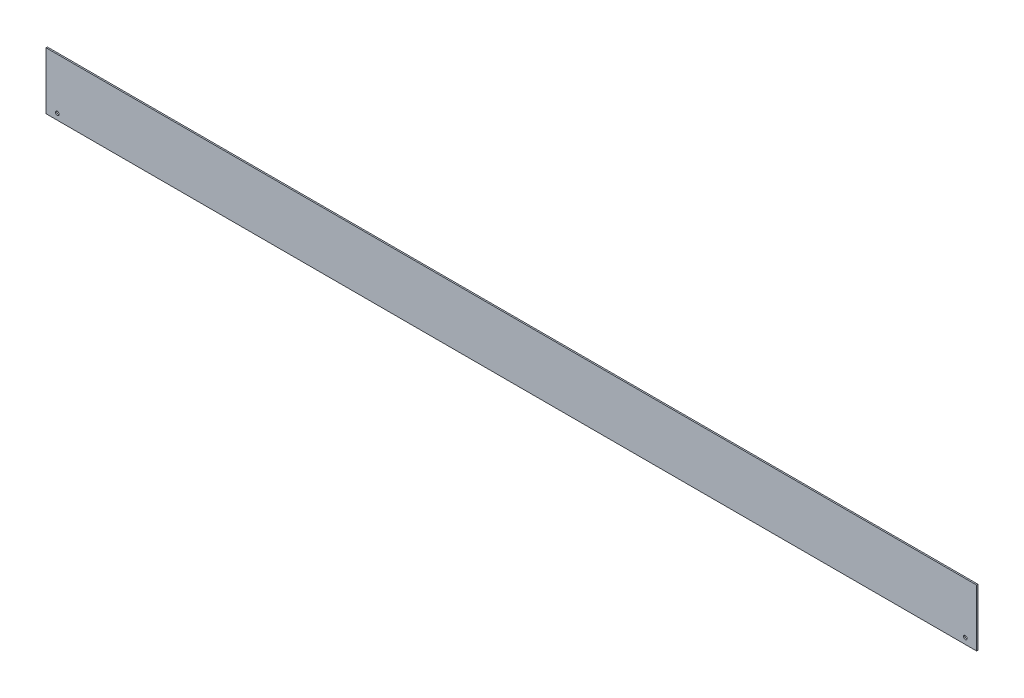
ISO-10303-21;
HEADER;
FILE_DESCRIPTION(('STEP AP214'),'2;1');
FILE_NAME('part.step','',(''),(''),'','','');
FILE_SCHEMA(('AUTOMOTIVE_DESIGN { 1 0 10303 214 1 1 1 1 }'));
ENDSEC;
DATA;
#1=APPLICATION_CONTEXT('core data for automotive mechanical design processes');
#2=APPLICATION_PROTOCOL_DEFINITION('international standard','automotive_design',2000,#1);
#3=PRODUCT_CONTEXT('',#1,'mechanical');
#4=PRODUCT('Part','Part','',(#3));
#5=PRODUCT_RELATED_PRODUCT_CATEGORY('part','',(#4));
#6=PRODUCT_DEFINITION_FORMATION('','',#4);
#7=PRODUCT_DEFINITION_CONTEXT('part definition',#1,'design');
#8=PRODUCT_DEFINITION('design','',#6,#7);
#9=PRODUCT_DEFINITION_SHAPE('','',#8);
#10=(LENGTH_UNIT() NAMED_UNIT(*) SI_UNIT(.MILLI.,.METRE.));
#11=(NAMED_UNIT(*) PLANE_ANGLE_UNIT() SI_UNIT($,.RADIAN.));
#12=(NAMED_UNIT(*) SI_UNIT($,.STERADIAN.) SOLID_ANGLE_UNIT());
#13=UNCERTAINTY_MEASURE_WITH_UNIT(LENGTH_MEASURE(1.E-05),#10,'distance_accuracy_value','');
#14=(GEOMETRIC_REPRESENTATION_CONTEXT(3) GLOBAL_UNCERTAINTY_ASSIGNED_CONTEXT((#13)) GLOBAL_UNIT_ASSIGNED_CONTEXT((#10,
#11,#12)) REPRESENTATION_CONTEXT('',''));
#15=CARTESIAN_POINT('',(0.,0.,0.));
#16=DIRECTION('',(0.,0.,1.));
#17=DIRECTION('',(1.,0.,0.));
#18=AXIS2_PLACEMENT_3D('',#15,#16,#17);
#19=CARTESIAN_POINT('',(-130.96888163,8.04449999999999,0.381));
#20=DIRECTION('',(1.,0.,0.));
#21=DIRECTION('',(0.,0.,-1.));
#22=AXIS2_PLACEMENT_3D('',#19,#20,#21);
#23=PLANE('',#22);
#24=DIRECTION('',(0.,-1.,0.));
#25=VECTOR('',#24,1.);
#26=CARTESIAN_POINT('',(-130.96888163,8.04449999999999,0.));
#27=LINE('',#26,#25);
#28=CARTESIAN_POINT('',(-130.96888163,8.04449999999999,0.));
#29=VERTEX_POINT('',#28);
#30=CARTESIAN_POINT('',(-130.96888163,-8.0445,0.));
#31=VERTEX_POINT('',#30);
#32=EDGE_CURVE('E93',#29,#31,#27,.T.);
#33=ORIENTED_EDGE('',*,*,#32,.T.);
#34=DIRECTION('',(0.,0.,-1.));
#35=VECTOR('',#34,1.);
#36=CARTESIAN_POINT('',(-130.96888163,-8.0445,0.381));
#37=LINE('',#36,#35);
#38=CARTESIAN_POINT('',(-130.96888163,-8.0445,0.381));
#39=VERTEX_POINT('',#38);
#40=EDGE_CURVE('E11',#39,#31,#37,.T.);
#41=ORIENTED_EDGE('',*,*,#40,.F.);
#42=DIRECTION('',(0.,-1.,0.));
#43=VECTOR('',#42,1.);
#44=CARTESIAN_POINT('',(-130.96888163,8.04449999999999,0.381));
#45=LINE('',#44,#43);
#46=CARTESIAN_POINT('',(-130.96888163,8.04449999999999,0.381));
#47=VERTEX_POINT('',#46);
#48=EDGE_CURVE('E81',#47,#39,#45,.T.);
#49=ORIENTED_EDGE('',*,*,#48,.F.);
#50=DIRECTION('',(0.,0.,-1.));
#51=VECTOR('',#50,1.);
#52=CARTESIAN_POINT('',(-130.96888163,8.04449999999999,0.381));
#53=LINE('',#52,#51);
#54=EDGE_CURVE('E89',#47,#29,#53,.T.);
#55=ORIENTED_EDGE('',*,*,#54,.T.);
#56=EDGE_LOOP('',(#33,#41,#49,#55));
#57=FACE_BOUND('',#56,.T.);
#58=ADVANCED_FACE('F30',(#57),#23,.F.);
#59=CARTESIAN_POINT('',(-130.96888163,-8.0445,0.381));
#60=DIRECTION('',(0.,1.,0.));
#61=DIRECTION('',(0.,0.,1.));
#62=AXIS2_PLACEMENT_3D('',#59,#60,#61);
#63=PLANE('',#62);
#64=DIRECTION('',(1.,0.,0.));
#65=VECTOR('',#64,1.);
#66=CARTESIAN_POINT('',(-130.96888163,-8.0445,0.));
#67=LINE('',#66,#65);
#68=CARTESIAN_POINT('',(130.96888163,-8.0445,0.));
#69=VERTEX_POINT('',#68);
#70=EDGE_CURVE('E85',#31,#69,#67,.T.);
#71=ORIENTED_EDGE('',*,*,#70,.T.);
#72=DIRECTION('',(0.,0.,-1.));
#73=VECTOR('',#72,1.);
#74=CARTESIAN_POINT('',(130.96888163,-8.0445,0.381));
#75=LINE('',#74,#73);
#76=CARTESIAN_POINT('',(130.96888163,-8.0445,0.381));
#77=VERTEX_POINT('',#76);
#78=EDGE_CURVE('E38',#77,#69,#75,.T.);
#79=ORIENTED_EDGE('',*,*,#78,.F.);
#80=DIRECTION('',(1.,0.,0.));
#81=VECTOR('',#80,1.);
#82=CARTESIAN_POINT('',(-130.96888163,-8.0445,0.381));
#83=LINE('',#82,#81);
#84=EDGE_CURVE('E76',#39,#77,#83,.T.);
#85=ORIENTED_EDGE('',*,*,#84,.F.);
#86=ORIENTED_EDGE('',*,*,#40,.T.);
#87=EDGE_LOOP('',(#71,#79,#85,#86));
#88=FACE_BOUND('',#87,.T.);
#89=ADVANCED_FACE('F84',(#88),#63,.F.);
#90=CARTESIAN_POINT('',(130.96888163,8.04449999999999,0.381));
#91=DIRECTION('',(-1.,0.,0.));
#92=DIRECTION('',(0.,0.,1.));
#93=AXIS2_PLACEMENT_3D('',#90,#91,#92);
#94=PLANE('',#93);
#95=DIRECTION('',(0.,1.,0.));
#96=VECTOR('',#95,1.);
#97=CARTESIAN_POINT('',(130.96888163,8.04449999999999,0.));
#98=LINE('',#97,#96);
#99=CARTESIAN_POINT('',(130.96888163,8.04449999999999,0.));
#100=VERTEX_POINT('',#99);
#101=EDGE_CURVE('E63',#69,#100,#98,.T.);
#102=ORIENTED_EDGE('',*,*,#101,.T.);
#103=DIRECTION('',(0.,0.,-1.));
#104=VECTOR('',#103,1.);
#105=CARTESIAN_POINT('',(130.96888163,8.04449999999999,0.381));
#106=LINE('',#105,#104);
#107=CARTESIAN_POINT('',(130.96888163,8.04449999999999,0.381));
#108=VERTEX_POINT('',#107);
#109=EDGE_CURVE('E86',#108,#100,#106,.T.);
#110=ORIENTED_EDGE('',*,*,#109,.F.);
#111=DIRECTION('',(0.,1.,0.));
#112=VECTOR('',#111,1.);
#113=CARTESIAN_POINT('',(130.96888163,8.04449999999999,0.381));
#114=LINE('',#113,#112);
#115=EDGE_CURVE('E79',#77,#108,#114,.T.);
#116=ORIENTED_EDGE('',*,*,#115,.F.);
#117=ORIENTED_EDGE('',*,*,#78,.T.);
#118=EDGE_LOOP('',(#102,#110,#116,#117));
#119=FACE_BOUND('',#118,.T.);
#120=ADVANCED_FACE('F87',(#119),#94,.F.);
#121=CARTESIAN_POINT('',(-130.96888163,8.04449999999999,0.381));
#122=DIRECTION('',(0.,-1.,0.));
#123=DIRECTION('',(0.,0.,-1.));
#124=AXIS2_PLACEMENT_3D('',#121,#122,#123);
#125=PLANE('',#124);
#126=DIRECTION('',(-1.,0.,0.));
#127=VECTOR('',#126,1.);
#128=CARTESIAN_POINT('',(-130.96888163,8.04449999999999,0.));
#129=LINE('',#128,#127);
#130=EDGE_CURVE('E69',#100,#29,#129,.T.);
#131=ORIENTED_EDGE('',*,*,#130,.T.);
#132=ORIENTED_EDGE('',*,*,#54,.F.);
#133=DIRECTION('',(-1.,0.,0.));
#134=VECTOR('',#133,1.);
#135=CARTESIAN_POINT('',(-130.96888163,8.04449999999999,0.381));
#136=LINE('',#135,#134);
#137=EDGE_CURVE('E46',#108,#47,#136,.T.);
#138=ORIENTED_EDGE('',*,*,#137,.F.);
#139=ORIENTED_EDGE('',*,*,#109,.T.);
#140=EDGE_LOOP('',(#131,#132,#138,#139));
#141=FACE_BOUND('',#140,.T.);
#142=ADVANCED_FACE('F101',(#141),#125,.F.);
#143=CARTESIAN_POINT('',(-130.96888163,-8.0445,0.381));
#144=DIRECTION('',(0.,0.,1.));
#145=DIRECTION('',(1.,0.,0.));
#146=AXIS2_PLACEMENT_3D('',#143,#144,#145);
#147=PLANE('',#146);
#148=CARTESIAN_POINT('',(127.79388163,-6.34449999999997,0.381));
#149=DIRECTION('',(0.,0.,1.));
#150=DIRECTION('',(-1.,0.,0.));
#151=AXIS2_PLACEMENT_3D('',#148,#149,#150);
#152=CIRCLE('',#151,0.508000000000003);
#153=CARTESIAN_POINT('',(127.28588163,-6.34449999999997,0.381));
#154=VERTEX_POINT('',#153);
#155=EDGE_CURVE('E113',#154,#154,#152,.T.);
#156=ORIENTED_EDGE('',*,*,#155,.F.);
#157=EDGE_LOOP('',(#156));
#158=FACE_BOUND('',#157,.T.);
#159=CARTESIAN_POINT('',(-127.79388163,-6.3445,0.381));
#160=DIRECTION('',(0.,0.,1.));
#161=DIRECTION('',(1.,0.,0.));
#162=AXIS2_PLACEMENT_3D('',#159,#160,#161);
#163=CIRCLE('',#162,0.508000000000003);
#164=CARTESIAN_POINT('',(-127.28588163,-6.3445,0.381));
#165=VERTEX_POINT('',#164);
#166=EDGE_CURVE('E107',#165,#165,#163,.T.);
#167=ORIENTED_EDGE('',*,*,#166,.F.);
#168=EDGE_LOOP('',(#167));
#169=FACE_BOUND('',#168,.T.);
#170=ORIENTED_EDGE('',*,*,#48,.T.);
#171=ORIENTED_EDGE('',*,*,#84,.T.);
#172=ORIENTED_EDGE('',*,*,#115,.T.);
#173=ORIENTED_EDGE('',*,*,#137,.T.);
#174=EDGE_LOOP('',(#170,#171,#172,#173));
#175=FACE_BOUND('',#174,.T.);
#176=ADVANCED_FACE('F77',(#158,#169,#175),#147,.T.);
#177=CARTESIAN_POINT('',(-130.96888163,-8.0445,0.));
#178=DIRECTION('',(0.,0.,1.));
#179=DIRECTION('',(1.,0.,0.));
#180=AXIS2_PLACEMENT_3D('',#177,#178,#179);
#181=PLANE('',#180);
#182=CARTESIAN_POINT('',(127.79388163,-6.34449999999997,0.));
#183=DIRECTION('',(0.,0.,1.));
#184=DIRECTION('',(-1.,0.,0.));
#185=AXIS2_PLACEMENT_3D('',#182,#183,#184);
#186=CIRCLE('',#185,0.508000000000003);
#187=CARTESIAN_POINT('',(127.28588163,-6.34449999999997,0.));
#188=VERTEX_POINT('',#187);
#189=EDGE_CURVE('E110',#188,#188,#186,.T.);
#190=ORIENTED_EDGE('',*,*,#189,.T.);
#191=EDGE_LOOP('',(#190));
#192=FACE_BOUND('',#191,.T.);
#193=CARTESIAN_POINT('',(-127.79388163,-6.3445,0.));
#194=DIRECTION('',(0.,0.,1.));
#195=DIRECTION('',(1.,0.,0.));
#196=AXIS2_PLACEMENT_3D('',#193,#194,#195);
#197=CIRCLE('',#196,0.508000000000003);
#198=CARTESIAN_POINT('',(-127.28588163,-6.3445,0.));
#199=VERTEX_POINT('',#198);
#200=EDGE_CURVE('E96',#199,#199,#197,.T.);
#201=ORIENTED_EDGE('',*,*,#200,.T.);
#202=EDGE_LOOP('',(#201));
#203=FACE_BOUND('',#202,.T.);
#204=ORIENTED_EDGE('',*,*,#32,.F.);
#205=ORIENTED_EDGE('',*,*,#130,.F.);
#206=ORIENTED_EDGE('',*,*,#101,.F.);
#207=ORIENTED_EDGE('',*,*,#70,.F.);
#208=EDGE_LOOP('',(#204,#205,#206,#207));
#209=FACE_BOUND('',#208,.T.);
#210=ADVANCED_FACE('F104',(#192,#203,#209),#181,.F.);
#211=CARTESIAN_POINT('',(-127.79388163,-6.3445,0.));
#212=DIRECTION('',(0.,0.,1.));
#213=DIRECTION('',(1.,0.,0.));
#214=AXIS2_PLACEMENT_3D('',#211,#212,#213);
#215=CYLINDRICAL_SURFACE('',#214,0.508000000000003);
#216=ORIENTED_EDGE('',*,*,#200,.F.);
#217=EDGE_LOOP('',(#216));
#218=FACE_BOUND('',#217,.T.);
#219=ORIENTED_EDGE('',*,*,#166,.T.);
#220=EDGE_LOOP('',(#219));
#221=FACE_BOUND('',#220,.T.);
#222=ADVANCED_FACE('F124',(#218,#221),#215,.F.);
#223=CARTESIAN_POINT('',(127.79388163,-6.34449999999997,0.));
#224=DIRECTION('',(0.,0.,1.));
#225=DIRECTION('',(1.,0.,0.));
#226=AXIS2_PLACEMENT_3D('',#223,#224,#225);
#227=CYLINDRICAL_SURFACE('',#226,0.508000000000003);
#228=ORIENTED_EDGE('',*,*,#189,.F.);
#229=EDGE_LOOP('',(#228));
#230=FACE_BOUND('',#229,.T.);
#231=ORIENTED_EDGE('',*,*,#155,.T.);
#232=EDGE_LOOP('',(#231));
#233=FACE_BOUND('',#232,.T.);
#234=ADVANCED_FACE('F121',(#230,#233),#227,.F.);
#235=CLOSED_SHELL('',(#58,#89,#120,#142,#176,#210,#222,#234));
#236=MANIFOLD_SOLID_BREP('B2',#235);
#237=ADVANCED_BREP_SHAPE_REPRESENTATION('',(#18,#236),#14);
#238=SHAPE_DEFINITION_REPRESENTATION(#9,#237);
ENDSEC;
END-ISO-10303-21;
